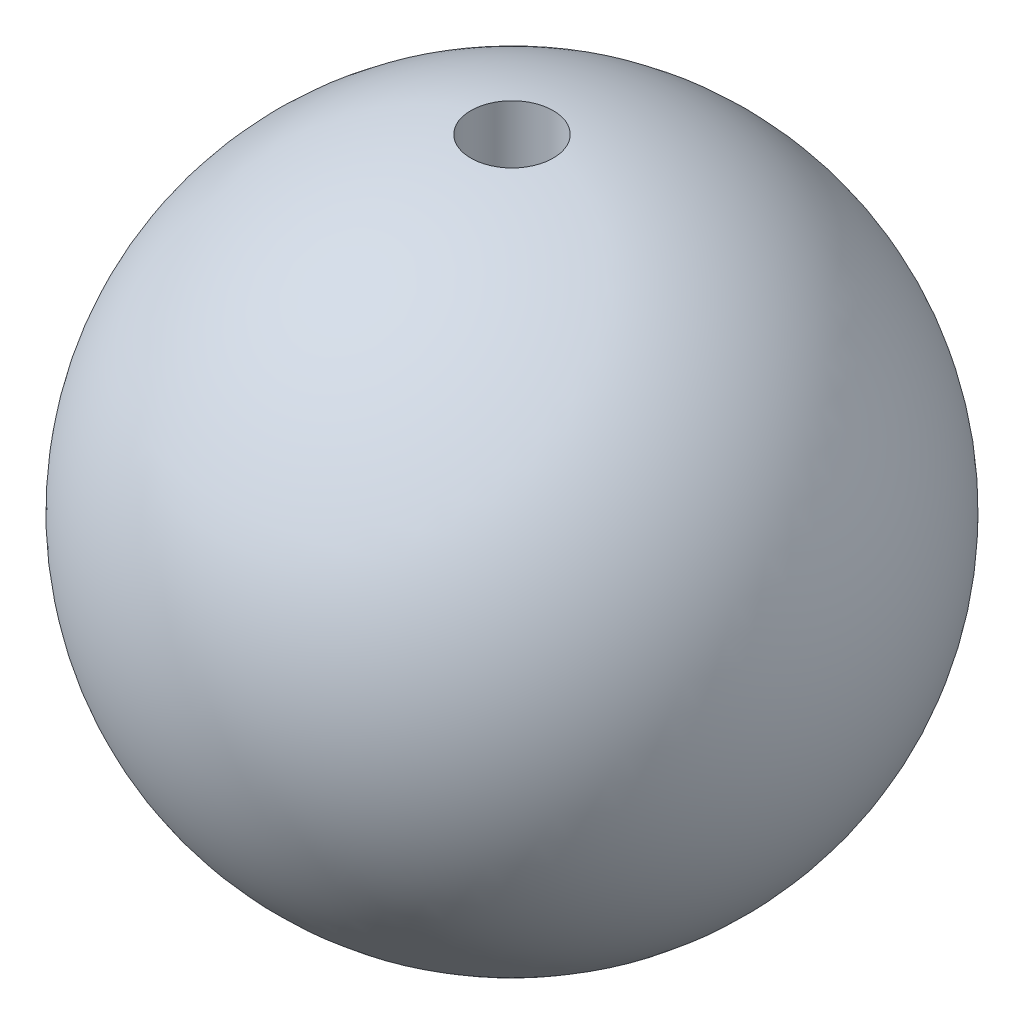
ISO-10303-21;
HEADER;
FILE_DESCRIPTION(('STEP AP214'),'2;1');
FILE_NAME('part.step','',(''),(''),'','','');
FILE_SCHEMA(('AUTOMOTIVE_DESIGN { 1 0 10303 214 1 1 1 1 }'));
ENDSEC;
DATA;
#1=APPLICATION_CONTEXT('core data for automotive mechanical design processes');
#2=APPLICATION_PROTOCOL_DEFINITION('international standard','automotive_design',2000,#1);
#3=PRODUCT_CONTEXT('',#1,'mechanical');
#4=PRODUCT('Part','Part','',(#3));
#5=PRODUCT_RELATED_PRODUCT_CATEGORY('part','',(#4));
#6=PRODUCT_DEFINITION_FORMATION('','',#4);
#7=PRODUCT_DEFINITION_CONTEXT('part definition',#1,'design');
#8=PRODUCT_DEFINITION('design','',#6,#7);
#9=PRODUCT_DEFINITION_SHAPE('','',#8);
#10=(LENGTH_UNIT() NAMED_UNIT(*) SI_UNIT(.MILLI.,.METRE.));
#11=(NAMED_UNIT(*) PLANE_ANGLE_UNIT() SI_UNIT($,.RADIAN.));
#12=(NAMED_UNIT(*) SI_UNIT($,.STERADIAN.) SOLID_ANGLE_UNIT());
#13=UNCERTAINTY_MEASURE_WITH_UNIT(LENGTH_MEASURE(1.E-05),#10,'distance_accuracy_value','');
#14=(GEOMETRIC_REPRESENTATION_CONTEXT(3) GLOBAL_UNCERTAINTY_ASSIGNED_CONTEXT((#13)) GLOBAL_UNIT_ASSIGNED_CONTEXT((#10,
#11,#12)) REPRESENTATION_CONTEXT('',''));
#15=CARTESIAN_POINT('',(0.,0.,0.));
#16=DIRECTION('',(0.,0.,1.));
#17=DIRECTION('',(1.,0.,0.));
#18=AXIS2_PLACEMENT_3D('',#15,#16,#17);
#19=CARTESIAN_POINT('',(0.,0.,0.));
#20=DIRECTION('',(0.,-1.,0.));
#21=DIRECTION('',(-1.,0.,0.));
#22=AXIS2_PLACEMENT_3D('',#19,#20,#21);
#23=SPHERICAL_SURFACE('',#22,12.7);
#24=CARTESIAN_POINT('',(0.,12.6003906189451,0.));
#25=DIRECTION('',(0.,-1.,0.));
#26=DIRECTION('',(0.,0.,-1.));
#27=AXIS2_PLACEMENT_3D('',#24,#25,#26);
#28=CIRCLE('',#27,1.5875);
#29=CARTESIAN_POINT('',(0.,12.6003906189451,-1.5875));
#30=VERTEX_POINT('',#29);
#31=EDGE_CURVE('E10',#30,#30,#28,.T.);
#32=ORIENTED_EDGE('',*,*,#31,.T.);
#33=EDGE_LOOP('',(#32));
#34=FACE_BOUND('',#33,.T.);
#35=ADVANCED_FACE('F34',(#34),#23,.T.);
#36=CARTESIAN_POINT('',(0.,12.7,0.));
#37=DIRECTION('',(0.,-1.,0.));
#38=DIRECTION('',(0.,0.,-1.));
#39=AXIS2_PLACEMENT_3D('',#36,#37,#38);
#40=CYLINDRICAL_SURFACE('',#39,1.5875);
#41=ORIENTED_EDGE('',*,*,#31,.F.);
#42=EDGE_LOOP('',(#41));
#43=FACE_BOUND('',#42,.T.);
#44=CARTESIAN_POINT('',(0.,0.,0.));
#45=DIRECTION('',(0.,1.,0.));
#46=DIRECTION('',(0.,0.,1.));
#47=AXIS2_PLACEMENT_3D('',#44,#45,#46);
#48=CIRCLE('',#47,1.5875);
#49=CARTESIAN_POINT('',(0.,0.,1.5875));
#50=VERTEX_POINT('',#49);
#51=EDGE_CURVE('E40',#50,#50,#48,.T.);
#52=ORIENTED_EDGE('',*,*,#51,.F.);
#53=EDGE_LOOP('',(#52));
#54=FACE_BOUND('',#53,.T.);
#55=ADVANCED_FACE('F48',(#43,#54),#40,.F.);
#56=CARTESIAN_POINT('',(0.,0.,0.));
#57=DIRECTION('',(0.,1.,0.));
#58=DIRECTION('',(0.,0.,1.));
#59=AXIS2_PLACEMENT_3D('',#56,#57,#58);
#60=PLANE('',#59);
#61=ORIENTED_EDGE('',*,*,#51,.T.);
#62=EDGE_LOOP('',(#61));
#63=FACE_BOUND('',#62,.T.);
#64=ADVANCED_FACE('F46',(#63),#60,.T.);
#65=CLOSED_SHELL('',(#35,#55,#64));
#66=MANIFOLD_SOLID_BREP('B2',#65);
#67=ADVANCED_BREP_SHAPE_REPRESENTATION('',(#18,#66),#14);
#68=SHAPE_DEFINITION_REPRESENTATION(#9,#67);
ENDSEC;
END-ISO-10303-21;
